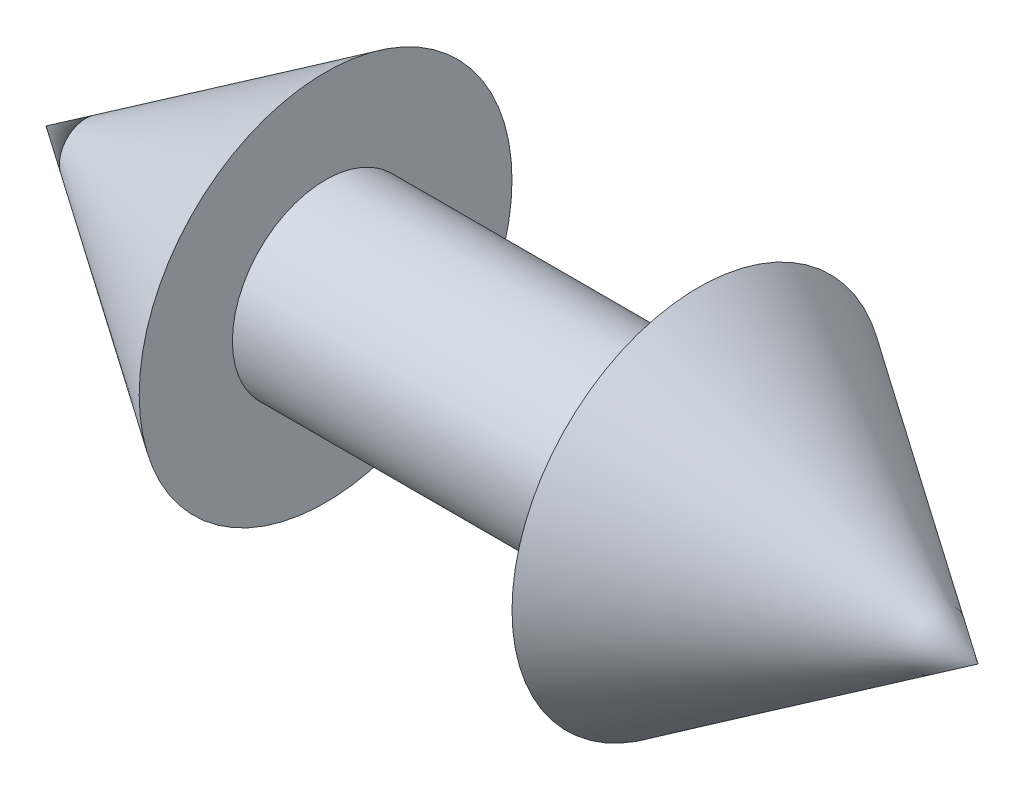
from build123d import *


with BuildPart() as part:
    # Esquisse1 → R_volution1 (revolve)
    with BuildSketch(Plane.XY, mode=Mode.PRIVATE) as r_volution1_sk:
        Polygon((-0.5, 0.25), (0.5, 0.25), (0.5, 0.5), (1.25, 0), (-1.25, 0), (-0.5, 0.5), align=None)
    revolve(r_volution1_sk.sketch.rotate(Axis((-1000, 0, 0), (1, 0, 0)), 90), axis=Axis((-1000, 0, 0), (1, 0, 0)))


solid = part.part
